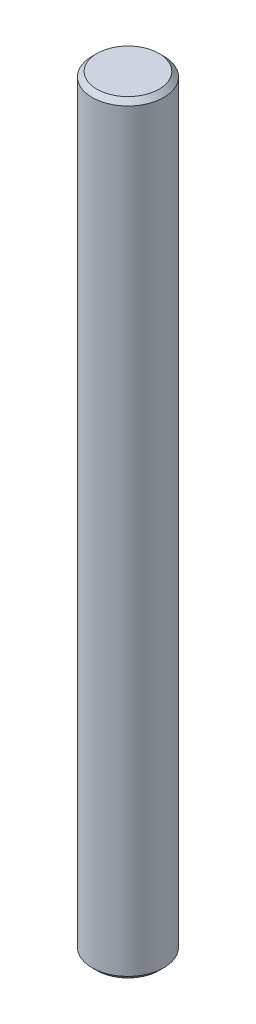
from build123d import *

# Parameters (mm, degrees)
SKETCH_2_R      = 0.75
EXTRUDE_1_DEPTH = 8
CHAMFER_1_SIZE  = 0.1


with BuildPart() as part:
    # Sketch 2 → Extrude 1 (new, symmetric)
    with BuildSketch(Plane(origin=(0, 0, 0), x_dir=(1, 0, 0), z_dir=(0, 1, 0))):
        with Locations(Location((0, 0, 0), (0, 0, 270))):
            Circle(SKETCH_2_R)
    extrude(amount=EXTRUDE_1_DEPTH, both=True)

    # Chamfer 1
    chamfer_1_edges = [part.edges().sort_by_distance(p)[0] for p in [
        (0, -8, -0.75),
        (0, 8, -0.75),
    ]]
    chamfer(chamfer_1_edges, length=CHAMFER_1_SIZE)


solid = part.part
